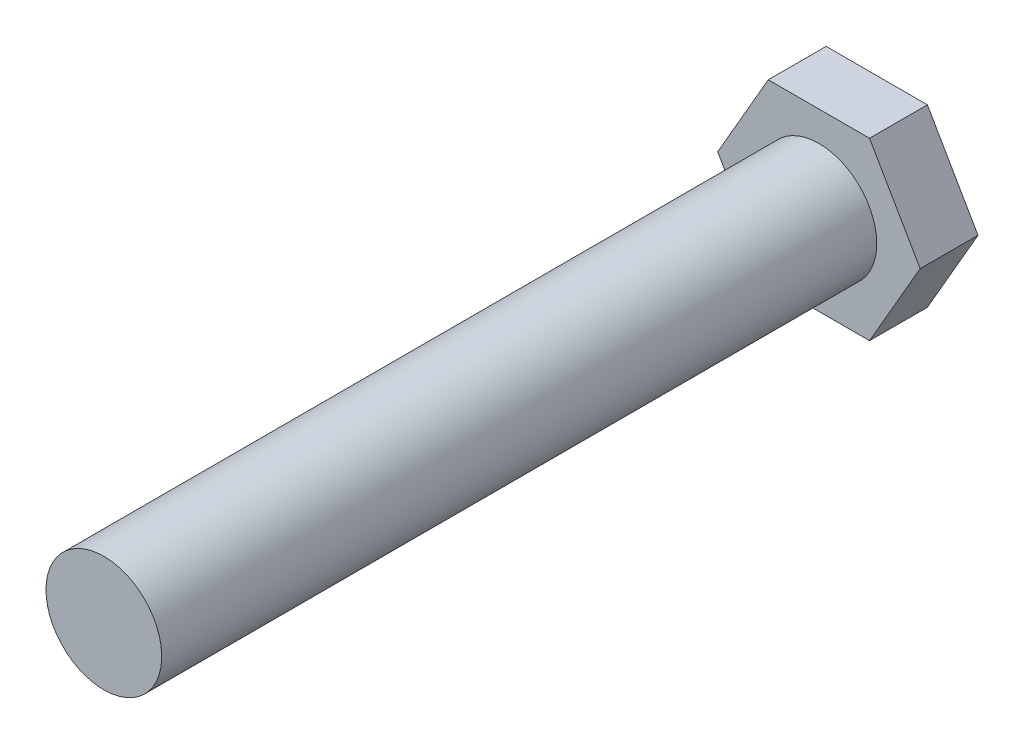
ISO-10303-21;
HEADER;
FILE_DESCRIPTION(('STEP AP214'),'2;1');
FILE_NAME('part.step','',(''),(''),'','','');
FILE_SCHEMA(('AUTOMOTIVE_DESIGN { 1 0 10303 214 1 1 1 1 }'));
ENDSEC;
DATA;
#1=APPLICATION_CONTEXT('core data for automotive mechanical design processes');
#2=APPLICATION_PROTOCOL_DEFINITION('international standard','automotive_design',2000,#1);
#3=PRODUCT_CONTEXT('',#1,'mechanical');
#4=PRODUCT('Part','Part','',(#3));
#5=PRODUCT_RELATED_PRODUCT_CATEGORY('part','',(#4));
#6=PRODUCT_DEFINITION_FORMATION('','',#4);
#7=PRODUCT_DEFINITION_CONTEXT('part definition',#1,'design');
#8=PRODUCT_DEFINITION('design','',#6,#7);
#9=PRODUCT_DEFINITION_SHAPE('','',#8);
#10=(LENGTH_UNIT() NAMED_UNIT(*) SI_UNIT(.MILLI.,.METRE.));
#11=(NAMED_UNIT(*) PLANE_ANGLE_UNIT() SI_UNIT($,.RADIAN.));
#12=(NAMED_UNIT(*) SI_UNIT($,.STERADIAN.) SOLID_ANGLE_UNIT());
#13=UNCERTAINTY_MEASURE_WITH_UNIT(LENGTH_MEASURE(1.E-05),#10,'distance_accuracy_value','');
#14=(GEOMETRIC_REPRESENTATION_CONTEXT(3) GLOBAL_UNCERTAINTY_ASSIGNED_CONTEXT((#13)) GLOBAL_UNIT_ASSIGNED_CONTEXT((#10,
#11,#12)) REPRESENTATION_CONTEXT('',''));
#15=CARTESIAN_POINT('',(0.,0.,0.));
#16=DIRECTION('',(0.,0.,1.));
#17=DIRECTION('',(1.,0.,0.));
#18=AXIS2_PLACEMENT_3D('',#15,#16,#17);
#19=CARTESIAN_POINT('',(-11.1125,-19.2474145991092,0.));
#20=DIRECTION('',(0.,-1.,0.));
#21=DIRECTION('',(0.,0.,-1.));
#22=AXIS2_PLACEMENT_3D('',#19,#20,#21);
#23=PLANE('',#22);
#24=DIRECTION('',(1.,0.,0.));
#25=VECTOR('',#24,1.);
#26=CARTESIAN_POINT('',(-11.1125,-19.2474145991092,12.7));
#27=LINE('',#26,#25);
#28=CARTESIAN_POINT('',(-11.1125,-19.2474145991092,12.7));
#29=VERTEX_POINT('',#28);
#30=CARTESIAN_POINT('',(11.1125,-19.2474145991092,12.7));
#31=VERTEX_POINT('',#30);
#32=EDGE_CURVE('E117',#29,#31,#27,.T.);
#33=ORIENTED_EDGE('',*,*,#32,.F.);
#34=DIRECTION('',(0.,0.,1.));
#35=VECTOR('',#34,1.);
#36=CARTESIAN_POINT('',(-11.1125,-19.2474145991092,0.));
#37=LINE('',#36,#35);
#38=CARTESIAN_POINT('',(-11.1125,-19.2474145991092,0.));
#39=VERTEX_POINT('',#38);
#40=EDGE_CURVE('E39',#39,#29,#37,.T.);
#41=ORIENTED_EDGE('',*,*,#40,.F.);
#42=DIRECTION('',(1.,0.,0.));
#43=VECTOR('',#42,1.);
#44=CARTESIAN_POINT('',(-11.1125,-19.2474145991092,0.));
#45=LINE('',#44,#43);
#46=CARTESIAN_POINT('',(11.1125,-19.2474145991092,0.));
#47=VERTEX_POINT('',#46);
#48=EDGE_CURVE('E133',#39,#47,#45,.T.);
#49=ORIENTED_EDGE('',*,*,#48,.T.);
#50=DIRECTION('',(0.,0.,1.));
#51=VECTOR('',#50,1.);
#52=CARTESIAN_POINT('',(11.1125,-19.2474145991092,0.));
#53=LINE('',#52,#51);
#54=EDGE_CURVE('E81',#47,#31,#53,.T.);
#55=ORIENTED_EDGE('',*,*,#54,.T.);
#56=EDGE_LOOP('',(#33,#41,#49,#55));
#57=FACE_BOUND('',#56,.T.);
#58=ADVANCED_FACE('F31',(#57),#23,.T.);
#59=CARTESIAN_POINT('',(-22.225,0.,0.));
#60=DIRECTION('',(-0.866025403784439,-0.5,0.));
#61=DIRECTION('',(0.5,-0.866025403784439,0.));
#62=AXIS2_PLACEMENT_3D('',#59,#60,#61);
#63=PLANE('',#62);
#64=DIRECTION('',(0.5,-0.866025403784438,0.));
#65=VECTOR('',#64,1.);
#66=CARTESIAN_POINT('',(-22.225,0.,12.7));
#67=LINE('',#66,#65);
#68=CARTESIAN_POINT('',(-22.225,0.,12.7));
#69=VERTEX_POINT('',#68);
#70=EDGE_CURVE('E130',#69,#29,#67,.T.);
#71=ORIENTED_EDGE('',*,*,#70,.F.);
#72=DIRECTION('',(0.,0.,1.));
#73=VECTOR('',#72,1.);
#74=CARTESIAN_POINT('',(-22.225,0.,0.));
#75=LINE('',#74,#73);
#76=CARTESIAN_POINT('',(-22.225,0.,0.));
#77=VERTEX_POINT('',#76);
#78=EDGE_CURVE('E69',#77,#69,#75,.T.);
#79=ORIENTED_EDGE('',*,*,#78,.F.);
#80=DIRECTION('',(0.5,-0.866025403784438,0.));
#81=VECTOR('',#80,1.);
#82=CARTESIAN_POINT('',(-22.225,0.,0.));
#83=LINE('',#82,#81);
#84=EDGE_CURVE('E107',#77,#39,#83,.T.);
#85=ORIENTED_EDGE('',*,*,#84,.T.);
#86=ORIENTED_EDGE('',*,*,#40,.T.);
#87=EDGE_LOOP('',(#71,#79,#85,#86));
#88=FACE_BOUND('',#87,.T.);
#89=ADVANCED_FACE('F142',(#88),#63,.T.);
#90=CARTESIAN_POINT('',(-11.1125,19.2474145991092,0.));
#91=DIRECTION('',(-0.866025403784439,0.5,0.));
#92=DIRECTION('',(-0.5,-0.866025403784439,0.));
#93=AXIS2_PLACEMENT_3D('',#90,#91,#92);
#94=PLANE('',#93);
#95=DIRECTION('',(-0.5,-0.866025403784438,0.));
#96=VECTOR('',#95,1.);
#97=CARTESIAN_POINT('',(-11.1125,19.2474145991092,12.7));
#98=LINE('',#97,#96);
#99=CARTESIAN_POINT('',(-11.1125,19.2474145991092,12.7));
#100=VERTEX_POINT('',#99);
#101=EDGE_CURVE('E94',#100,#69,#98,.T.);
#102=ORIENTED_EDGE('',*,*,#101,.F.);
#103=DIRECTION('',(0.,0.,1.));
#104=VECTOR('',#103,1.);
#105=CARTESIAN_POINT('',(-11.1125,19.2474145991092,0.));
#106=LINE('',#105,#104);
#107=CARTESIAN_POINT('',(-11.1125,19.2474145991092,0.));
#108=VERTEX_POINT('',#107);
#109=EDGE_CURVE('E89',#108,#100,#106,.T.);
#110=ORIENTED_EDGE('',*,*,#109,.F.);
#111=DIRECTION('',(-0.5,-0.866025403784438,0.));
#112=VECTOR('',#111,1.);
#113=CARTESIAN_POINT('',(-11.1125,19.2474145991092,0.));
#114=LINE('',#113,#112);
#115=EDGE_CURVE('E92',#108,#77,#114,.T.);
#116=ORIENTED_EDGE('',*,*,#115,.T.);
#117=ORIENTED_EDGE('',*,*,#78,.T.);
#118=EDGE_LOOP('',(#102,#110,#116,#117));
#119=FACE_BOUND('',#118,.T.);
#120=ADVANCED_FACE('F91',(#119),#94,.T.);
#121=CARTESIAN_POINT('',(11.1125,19.2474145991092,0.));
#122=DIRECTION('',(0.,1.,0.));
#123=DIRECTION('',(0.,0.,1.));
#124=AXIS2_PLACEMENT_3D('',#121,#122,#123);
#125=PLANE('',#124);
#126=DIRECTION('',(-1.,0.,0.));
#127=VECTOR('',#126,1.);
#128=CARTESIAN_POINT('',(11.1125,19.2474145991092,12.7));
#129=LINE('',#128,#127);
#130=CARTESIAN_POINT('',(11.1125,19.2474145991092,12.7));
#131=VERTEX_POINT('',#130);
#132=EDGE_CURVE('E127',#131,#100,#129,.T.);
#133=ORIENTED_EDGE('',*,*,#132,.F.);
#134=DIRECTION('',(0.,0.,1.));
#135=VECTOR('',#134,1.);
#136=CARTESIAN_POINT('',(11.1125,19.2474145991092,0.));
#137=LINE('',#136,#135);
#138=CARTESIAN_POINT('',(11.1125,19.2474145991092,0.));
#139=VERTEX_POINT('',#138);
#140=EDGE_CURVE('E99',#139,#131,#137,.T.);
#141=ORIENTED_EDGE('',*,*,#140,.F.);
#142=DIRECTION('',(-1.,0.,0.));
#143=VECTOR('',#142,1.);
#144=CARTESIAN_POINT('',(11.1125,19.2474145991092,0.));
#145=LINE('',#144,#143);
#146=EDGE_CURVE('E105',#139,#108,#145,.T.);
#147=ORIENTED_EDGE('',*,*,#146,.T.);
#148=ORIENTED_EDGE('',*,*,#109,.T.);
#149=EDGE_LOOP('',(#133,#141,#147,#148));
#150=FACE_BOUND('',#149,.T.);
#151=ADVANCED_FACE('F109',(#150),#125,.T.);
#152=CARTESIAN_POINT('',(22.225,0.,0.));
#153=DIRECTION('',(0.866025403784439,0.5,0.));
#154=DIRECTION('',(-0.5,0.866025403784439,0.));
#155=AXIS2_PLACEMENT_3D('',#152,#153,#154);
#156=PLANE('',#155);
#157=DIRECTION('',(-0.5,0.866025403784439,0.));
#158=VECTOR('',#157,1.);
#159=CARTESIAN_POINT('',(22.225,0.,12.7));
#160=LINE('',#159,#158);
#161=CARTESIAN_POINT('',(22.225,0.,12.7));
#162=VERTEX_POINT('',#161);
#163=EDGE_CURVE('E124',#162,#131,#160,.T.);
#164=ORIENTED_EDGE('',*,*,#163,.F.);
#165=DIRECTION('',(0.,0.,1.));
#166=VECTOR('',#165,1.);
#167=CARTESIAN_POINT('',(22.225,0.,0.));
#168=LINE('',#167,#166);
#169=CARTESIAN_POINT('',(22.225,0.,0.));
#170=VERTEX_POINT('',#169);
#171=EDGE_CURVE('E137',#170,#162,#168,.T.);
#172=ORIENTED_EDGE('',*,*,#171,.F.);
#173=DIRECTION('',(-0.5,0.866025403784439,0.));
#174=VECTOR('',#173,1.);
#175=CARTESIAN_POINT('',(22.225,0.,0.));
#176=LINE('',#175,#174);
#177=EDGE_CURVE('E110',#170,#139,#176,.T.);
#178=ORIENTED_EDGE('',*,*,#177,.T.);
#179=ORIENTED_EDGE('',*,*,#140,.T.);
#180=EDGE_LOOP('',(#164,#172,#178,#179));
#181=FACE_BOUND('',#180,.T.);
#182=ADVANCED_FACE('F155',(#181),#156,.T.);
#183=CARTESIAN_POINT('',(11.1125,-19.2474145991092,0.));
#184=DIRECTION('',(0.866025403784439,-0.5,0.));
#185=DIRECTION('',(0.5,0.866025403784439,0.));
#186=AXIS2_PLACEMENT_3D('',#183,#184,#185);
#187=PLANE('',#186);
#188=DIRECTION('',(0.5,0.866025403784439,0.));
#189=VECTOR('',#188,1.);
#190=CARTESIAN_POINT('',(11.1125,-19.2474145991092,12.7));
#191=LINE('',#190,#189);
#192=EDGE_CURVE('E120',#31,#162,#191,.T.);
#193=ORIENTED_EDGE('',*,*,#192,.F.);
#194=ORIENTED_EDGE('',*,*,#54,.F.);
#195=DIRECTION('',(0.5,0.866025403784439,0.));
#196=VECTOR('',#195,1.);
#197=CARTESIAN_POINT('',(11.1125,-19.2474145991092,0.));
#198=LINE('',#197,#196);
#199=EDGE_CURVE('E112',#47,#170,#198,.T.);
#200=ORIENTED_EDGE('',*,*,#199,.T.);
#201=ORIENTED_EDGE('',*,*,#171,.T.);
#202=EDGE_LOOP('',(#193,#194,#200,#201));
#203=FACE_BOUND('',#202,.T.);
#204=ADVANCED_FACE('F138',(#203),#187,.T.);
#205=CARTESIAN_POINT('',(11.1125,-19.2474145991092,0.));
#206=DIRECTION('',(0.,0.,1.));
#207=DIRECTION('',(1.,0.,0.));
#208=AXIS2_PLACEMENT_3D('',#205,#206,#207);
#209=PLANE('',#208);
#210=ORIENTED_EDGE('',*,*,#48,.F.);
#211=ORIENTED_EDGE('',*,*,#84,.F.);
#212=ORIENTED_EDGE('',*,*,#115,.F.);
#213=ORIENTED_EDGE('',*,*,#146,.F.);
#214=ORIENTED_EDGE('',*,*,#177,.F.);
#215=ORIENTED_EDGE('',*,*,#199,.F.);
#216=EDGE_LOOP('',(#210,#211,#212,#213,#214,#215));
#217=FACE_BOUND('',#216,.T.);
#218=ADVANCED_FACE('F103',(#217),#209,.F.);
#219=CARTESIAN_POINT('',(11.1125,-19.2474145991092,12.7));
#220=DIRECTION('',(0.,0.,1.));
#221=DIRECTION('',(1.,0.,0.));
#222=AXIS2_PLACEMENT_3D('',#219,#220,#221);
#223=PLANE('',#222);
#224=CARTESIAN_POINT('',(0.,0.,12.7));
#225=DIRECTION('',(0.,0.,1.));
#226=DIRECTION('',(1.,0.,0.));
#227=AXIS2_PLACEMENT_3D('',#224,#225,#226);
#228=CIRCLE('',#227,12.7);
#229=CARTESIAN_POINT('',(12.7,0.,12.7));
#230=VERTEX_POINT('',#229);
#231=EDGE_CURVE('E11',#230,#230,#228,.T.);
#232=ORIENTED_EDGE('',*,*,#231,.F.);
#233=EDGE_LOOP('',(#232));
#234=FACE_BOUND('',#233,.T.);
#235=ORIENTED_EDGE('',*,*,#32,.T.);
#236=ORIENTED_EDGE('',*,*,#192,.T.);
#237=ORIENTED_EDGE('',*,*,#163,.T.);
#238=ORIENTED_EDGE('',*,*,#132,.T.);
#239=ORIENTED_EDGE('',*,*,#101,.T.);
#240=ORIENTED_EDGE('',*,*,#70,.T.);
#241=EDGE_LOOP('',(#235,#236,#237,#238,#239,#240));
#242=FACE_BOUND('',#241,.T.);
#243=ADVANCED_FACE('F141',(#234,#242),#223,.T.);
#244=CARTESIAN_POINT('',(0.,0.,169.672));
#245=DIRECTION('',(0.,0.,-1.));
#246=DIRECTION('',(-1.,0.,0.));
#247=AXIS2_PLACEMENT_3D('',#244,#245,#246);
#248=CYLINDRICAL_SURFACE('',#247,12.7);
#249=CARTESIAN_POINT('',(0.,0.,169.672));
#250=DIRECTION('',(0.,0.,-1.));
#251=DIRECTION('',(-1.,0.,0.));
#252=AXIS2_PLACEMENT_3D('',#249,#250,#251);
#253=CIRCLE('',#252,12.7);
#254=CARTESIAN_POINT('',(-12.7,0.,169.672));
#255=VERTEX_POINT('',#254);
#256=EDGE_CURVE('E121',#255,#255,#253,.T.);
#257=ORIENTED_EDGE('',*,*,#256,.T.);
#258=EDGE_LOOP('',(#257));
#259=FACE_BOUND('',#258,.T.);
#260=ORIENTED_EDGE('',*,*,#231,.T.);
#261=EDGE_LOOP('',(#260));
#262=FACE_BOUND('',#261,.T.);
#263=ADVANCED_FACE('F165',(#259,#262),#248,.T.);
#264=CARTESIAN_POINT('',(12.7,0.,169.672));
#265=DIRECTION('',(0.,0.,1.));
#266=DIRECTION('',(1.,0.,0.));
#267=AXIS2_PLACEMENT_3D('',#264,#265,#266);
#268=PLANE('',#267);
#269=ORIENTED_EDGE('',*,*,#256,.F.);
#270=EDGE_LOOP('',(#269));
#271=FACE_BOUND('',#270,.T.);
#272=ADVANCED_FACE('F170',(#271),#268,.T.);
#273=CLOSED_SHELL('',(#58,#89,#120,#151,#182,#204,#218,#243,#263,#272));
#274=MANIFOLD_SOLID_BREP('B2',#273);
#275=ADVANCED_BREP_SHAPE_REPRESENTATION('',(#18,#274),#14);
#276=SHAPE_DEFINITION_REPRESENTATION(#9,#275);
ENDSEC;
END-ISO-10303-21;
